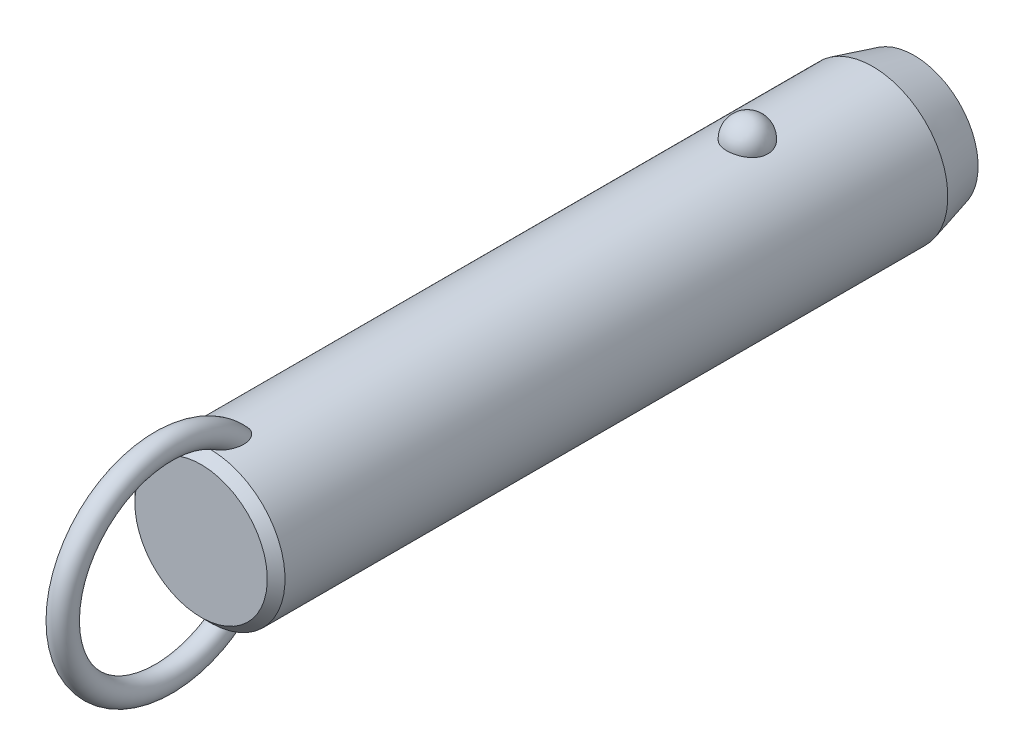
ISO-10303-21;
HEADER;
FILE_DESCRIPTION(('STEP AP214'),'2;1');
FILE_NAME('part.step','',(''),(''),'','','');
FILE_SCHEMA(('AUTOMOTIVE_DESIGN { 1 0 10303 214 1 1 1 1 }'));
ENDSEC;
DATA;
#1=APPLICATION_CONTEXT('core data for automotive mechanical design processes');
#2=APPLICATION_PROTOCOL_DEFINITION('international standard','automotive_design',2000,#1);
#3=PRODUCT_CONTEXT('',#1,'mechanical');
#4=PRODUCT('Part','Part','',(#3));
#5=PRODUCT_RELATED_PRODUCT_CATEGORY('part','',(#4));
#6=PRODUCT_DEFINITION_FORMATION('','',#4);
#7=PRODUCT_DEFINITION_CONTEXT('part definition',#1,'design');
#8=PRODUCT_DEFINITION('design','',#6,#7);
#9=PRODUCT_DEFINITION_SHAPE('','',#8);
#10=(LENGTH_UNIT() NAMED_UNIT(*) SI_UNIT(.MILLI.,.METRE.));
#11=(NAMED_UNIT(*) PLANE_ANGLE_UNIT() SI_UNIT($,.RADIAN.));
#12=(NAMED_UNIT(*) SI_UNIT($,.STERADIAN.) SOLID_ANGLE_UNIT());
#13=UNCERTAINTY_MEASURE_WITH_UNIT(LENGTH_MEASURE(1.E-05),#10,'distance_accuracy_value','');
#14=(GEOMETRIC_REPRESENTATION_CONTEXT(3) GLOBAL_UNCERTAINTY_ASSIGNED_CONTEXT((#13)) GLOBAL_UNIT_ASSIGNED_CONTEXT((#10,
#11,#12)) REPRESENTATION_CONTEXT('',''));
#15=CARTESIAN_POINT('',(0.,0.,0.));
#16=DIRECTION('',(0.,0.,1.));
#17=DIRECTION('',(1.,0.,0.));
#18=AXIS2_PLACEMENT_3D('',#15,#16,#17);
#19=CARTESIAN_POINT('',(0.,0.,76.2));
#20=DIRECTION('',(0.,0.,-1.));
#21=DIRECTION('',(-1.,0.,0.));
#22=AXIS2_PLACEMENT_3D('',#19,#20,#21);
#23=CYLINDRICAL_SURFACE('',#22,12.7);
#24=CARTESIAN_POINT('',(3.46661256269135,12.2177165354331,-3.5));
#25=CARTESIAN_POINT('',(3.4666090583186,12.2177194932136,-3.30432790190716));
#26=CARTESIAN_POINT('',(3.45063567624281,12.2222841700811,-3.10861112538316));
#27=CARTESIAN_POINT('',(3.38712451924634,12.2400345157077,-2.72271899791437));
#28=CARTESIAN_POINT('',(3.33957415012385,12.2532236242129,-2.53254588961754));
#29=CARTESIAN_POINT('',(3.2141234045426,12.286724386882,-2.16324948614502));
#30=CARTESIAN_POINT('',(3.13623639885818,12.3070329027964,-1.98412136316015));
#31=CARTESIAN_POINT('',(2.95205930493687,12.3525018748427,-1.64180592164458));
#32=CARTESIAN_POINT('',(2.84577003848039,12.3776621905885,-1.47861814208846));
#33=CARTESIAN_POINT('',(2.60688050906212,12.4301712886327,-1.17190583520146));
#34=CARTESIAN_POINT('',(2.47415697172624,12.4575299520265,-1.02847897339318));
#35=CARTESIAN_POINT('',(2.18615174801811,12.5112810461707,-0.766177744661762));
#36=CARTESIAN_POINT('',(2.03087002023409,12.5376734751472,-0.64730342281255));
#37=CARTESIAN_POINT('',(1.70237334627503,12.5864761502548,-0.437732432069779));
#38=CARTESIAN_POINT('',(1.52920948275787,12.6088972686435,-0.346958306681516));
#39=CARTESIAN_POINT('',(1.16944170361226,12.6473352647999,-0.195750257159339));
#40=CARTESIAN_POINT('',(0.982839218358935,12.663352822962,-0.135313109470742));
#41=CARTESIAN_POINT('',(0.604961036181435,12.6869706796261,-0.0473241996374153));
#42=CARTESIAN_POINT('',(0.413823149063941,12.6947125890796,-0.0192185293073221));
#43=CARTESIAN_POINT('',(0.0293827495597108,12.7014203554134,0.00517254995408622));
#44=CARTESIAN_POINT('',(-0.163919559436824,12.7003870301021,0.00146092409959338));
#45=CARTESIAN_POINT('',(-0.544374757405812,12.689735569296,-0.0373939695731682));
#46=CARTESIAN_POINT('',(-0.731575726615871,12.6802364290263,-0.0721015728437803));
#47=CARTESIAN_POINT('',(-1.09733277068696,12.6538333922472,-0.171364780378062));
#48=CARTESIAN_POINT('',(-1.27588869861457,12.6369293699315,-0.235920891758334));
#49=CARTESIAN_POINT('',(-1.6204698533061,12.5973946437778,-0.393548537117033));
#50=CARTESIAN_POINT('',(-1.78641865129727,12.5747321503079,-0.486778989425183));
#51=CARTESIAN_POINT('',(-2.10030671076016,12.5261316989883,-0.699110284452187));
#52=CARTESIAN_POINT('',(-2.24824419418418,12.5001934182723,-0.818213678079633));
#53=CARTESIAN_POINT('',(-2.52491489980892,12.4472906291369,-1.08157124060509));
#54=CARTESIAN_POINT('',(-2.65324222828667,12.4203160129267,-1.22624992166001));
#55=CARTESIAN_POINT('',(-2.88410007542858,12.3687509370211,-1.53528325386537));
#56=CARTESIAN_POINT('',(-2.98662883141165,12.3441606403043,-1.69963924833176));
#57=CARTESIAN_POINT('',(-3.16432417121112,12.2998199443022,-2.04548497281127));
#58=CARTESIAN_POINT('',(-3.23917525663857,12.2801261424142,-2.22714424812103));
#59=CARTESIAN_POINT('',(-3.35800573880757,12.248167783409,-2.6009138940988));
#60=CARTESIAN_POINT('',(-3.4019860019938,12.2359030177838,-2.79302397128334));
#61=CARTESIAN_POINT('',(-3.45784812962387,12.2202347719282,-3.18140279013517));
#62=CARTESIAN_POINT('',(-3.46986123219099,12.2167950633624,-3.37765118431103));
#63=CARTESIAN_POINT('',(-3.46186273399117,12.2190638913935,-3.76943689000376));
#64=CARTESIAN_POINT('',(-3.44185196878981,12.2247721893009,-3.96497421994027));
#65=CARTESIAN_POINT('',(-3.37048652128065,12.2446381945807,-4.34881728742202));
#66=CARTESIAN_POINT('',(-3.31928253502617,12.2587552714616,-4.53715319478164));
#67=CARTESIAN_POINT('',(-3.18693461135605,12.2938237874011,-4.90231727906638));
#68=CARTESIAN_POINT('',(-3.1057895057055,12.3147754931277,-5.07914500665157));
#69=CARTESIAN_POINT('',(-2.91506431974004,12.3613125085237,-5.41732059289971));
#70=CARTESIAN_POINT('',(-2.80533587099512,12.3869217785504,-5.57858147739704));
#71=CARTESIAN_POINT('',(-2.560414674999,12.4398525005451,-5.88013283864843));
#72=CARTESIAN_POINT('',(-2.42522099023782,12.4671740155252,-6.02042254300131));
#73=CARTESIAN_POINT('',(-2.1323357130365,12.5205965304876,-6.27662798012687));
#74=CARTESIAN_POINT('',(-1.97456596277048,12.5466928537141,-6.3924554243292));
#75=CARTESIAN_POINT('',(-1.64115839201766,12.5946384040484,-6.59583547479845));
#76=CARTESIAN_POINT('',(-1.46552179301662,12.6164879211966,-6.68339001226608));
#77=CARTESIAN_POINT('',(-1.10356050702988,12.6532533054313,-6.82682153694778));
#78=CARTESIAN_POINT('',(-0.917391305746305,12.6682500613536,-6.8830698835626));
#79=CARTESIAN_POINT('',(-0.537836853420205,12.6900288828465,-6.96386887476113));
#80=CARTESIAN_POINT('',(-0.344452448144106,12.6968119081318,-6.9884232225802));
#81=CARTESIAN_POINT('',(0.0402577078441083,12.7013667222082,-7.00496469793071));
#82=CARTESIAN_POINT('',(0.231556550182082,12.6993008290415,-6.99753844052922));
#83=CARTESIAN_POINT('',(0.610105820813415,12.6867505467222,-6.9516636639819));
#84=CARTESIAN_POINT('',(0.797356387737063,12.6762664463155,-6.913216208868));
#85=CARTESIAN_POINT('',(1.16186657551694,12.6480587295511,-6.80658431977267));
#86=CARTESIAN_POINT('',(1.33915951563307,12.6303611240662,-6.73850666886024));
#87=CARTESIAN_POINT('',(1.67968518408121,12.5896027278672,-6.5745087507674));
#88=CARTESIAN_POINT('',(1.84291705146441,12.5665416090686,-6.47858678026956));
#89=CARTESIAN_POINT('',(2.15340192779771,12.5171072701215,-6.25982455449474));
#90=CARTESIAN_POINT('',(2.30037831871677,12.4906895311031,-6.13660186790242));
#91=CARTESIAN_POINT('',(2.5717412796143,12.4376567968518,-5.86739587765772));
#92=CARTESIAN_POINT('',(2.69612388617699,12.4110417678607,-5.72140858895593));
#93=CARTESIAN_POINT('',(2.92107785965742,12.360051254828,-5.40794137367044));
#94=CARTESIAN_POINT('',(3.02121329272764,12.3357209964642,-5.24014110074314));
#95=CARTESIAN_POINT('',(3.19236291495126,12.2925446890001,-4.88969865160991));
#96=CARTESIAN_POINT('',(3.26338839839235,12.2736965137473,-4.70706226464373));
#97=CARTESIAN_POINT('',(3.36788038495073,12.245404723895,-4.35469510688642));
#98=CARTESIAN_POINT('',(3.40484026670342,12.2351018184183,-4.18605935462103));
#99=CARTESIAN_POINT('',(3.45420764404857,12.2212564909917,-3.84496058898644));
#100=CARTESIAN_POINT('',(3.46661565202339,12.2177139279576,-3.67249765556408));
#101=CARTESIAN_POINT('',(3.46661256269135,12.2177165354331,-3.5));
#102=B_SPLINE_CURVE_WITH_KNOTS('',3,(#24,#25,#26,#27,#28,#29,#30,#31,#32,#33,#34,#35,#36,#37,
#38,#39,#40,#41,#42,#43,#44,#45,#46,#47,#48,#49,#50,#51,#52,#53,#54,#55,#56,#57,#58,#59,#60,#61,
#62,#63,#64,#65,#66,#67,#68,#69,#70,#71,#72,#73,#74,#75,#76,#77,#78,#79,#80,#81,#82,#83,#84,#85,
#86,#87,#88,#89,#90,#91,#92,#93,#94,#95,#96,#97,#98,#99,#100,#101),.UNSPECIFIED.,.T.,.F.,(4,2,2,
2,2,2,2,2,2,2,2,2,2,2,2,2,2,2,2,2,2,2,2,2,2,2,2,2,2,2,2,2,2,2,2,2,2,2,4),(0.,0.586396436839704,
1.17302689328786,1.7593990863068,2.34575431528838,2.93491084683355,3.52406845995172,
4.11158733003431,4.69904375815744,5.2762784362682,5.85345931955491,6.42265312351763,
6.99185659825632,7.56427334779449,8.136746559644,8.71981013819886,9.3029135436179,
9.89247258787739,10.4820150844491,11.0691335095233,11.6562366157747,12.2405256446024,
12.8248374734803,13.412244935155,13.9996740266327,14.5891883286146,15.1786623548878,
15.7609861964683,16.3432419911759,16.914863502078,17.4864654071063,18.056024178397,
18.6256177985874,19.2037609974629,19.7820055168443,20.3699810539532,20.9577282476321,
21.4746855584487,21.9916320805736),.UNSPECIFIED.);
#103=CARTESIAN_POINT('',(3.46661256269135,12.2177165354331,-3.5));
#104=VERTEX_POINT('',#103);
#105=EDGE_CURVE('E41',#104,#104,#102,.T.);
#106=ORIENTED_EDGE('',*,*,#105,.T.);
#107=EDGE_LOOP('',(#106));
#108=FACE_BOUND('',#107,.T.);
#109=CARTESIAN_POINT('',(0.,0.,87.4000000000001));
#110=DIRECTION('',(0.,0.,1.));
#111=DIRECTION('',(1.,0.,0.));
#112=AXIS2_PLACEMENT_3D('',#109,#110,#111);
#113=CIRCLE('',#112,12.7);
#114=CARTESIAN_POINT('',(-12.7,0.,87.4000000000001));
#115=VERTEX_POINT('',#114);
#116=EDGE_CURVE('E10',#115,#115,#113,.F.);
#117=ORIENTED_EDGE('',*,*,#116,.T.);
#118=EDGE_LOOP('',(#117));
#119=FACE_BOUND('',#118,.T.);
#120=CARTESIAN_POINT('',(-0.548122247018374,-12.6881662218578,81.1432187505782));
#121=CARTESIAN_POINT('',(-0.648865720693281,-12.6838128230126,81.177926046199));
#122=CARTESIAN_POINT('',(-0.746398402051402,-12.6783867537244,81.2220428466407));
#123=CARTESIAN_POINT('',(-0.93212506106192,-12.666091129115,81.3267647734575));
#124=CARTESIAN_POINT('',(-1.02030388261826,-12.6592192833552,81.387396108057));
#125=CARTESIAN_POINT('',(-1.18487740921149,-12.6448747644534,81.521847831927));
#126=CARTESIAN_POINT('',(-1.26134296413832,-12.637406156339,81.5955825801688));
#127=CARTESIAN_POINT('',(-1.40231200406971,-12.6225412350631,81.7536045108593));
#128=CARTESIAN_POINT('',(-1.46681470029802,-12.6151449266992,81.8378923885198));
#129=CARTESIAN_POINT('',(-1.60714786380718,-12.5981718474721,82.0496577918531));
#130=CARTESIAN_POINT('',(-1.67725126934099,-12.588900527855,82.180962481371));
#131=CARTESIAN_POINT('',(-1.79536591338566,-12.5725964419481,82.4532471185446));
#132=CARTESIAN_POINT('',(-1.84333535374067,-12.5655679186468,82.5942447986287));
#133=CARTESIAN_POINT('',(-1.93422576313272,-12.5519624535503,82.9376455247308));
#134=CARTESIAN_POINT('',(-1.96788773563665,-12.5466298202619,83.1425578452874));
#135=CARTESIAN_POINT('',(-1.9941399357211,-12.542463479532,83.4517600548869));
#136=CARTESIAN_POINT('',(-1.99883864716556,-12.5417153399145,83.5552987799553));
#137=CARTESIAN_POINT('',(-2.00078003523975,-12.5414074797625,83.7624512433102));
#138=CARTESIAN_POINT('',(-1.99802449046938,-12.5418474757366,83.8660649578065));
#139=CARTESIAN_POINT('',(-1.98336733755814,-12.5441750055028,84.1103207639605));
#140=CARTESIAN_POINT('',(-1.96851430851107,-12.5465291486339,84.2507804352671));
#141=CARTESIAN_POINT('',(-1.92707089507,-12.5529612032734,84.5299607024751));
#142=CARTESIAN_POINT('',(-1.90047458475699,-12.5570399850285,84.6686803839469));
#143=CARTESIAN_POINT('',(-1.8361912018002,-12.5666008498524,84.9434113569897));
#144=CARTESIAN_POINT('',(-1.79850828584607,-12.57208240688,85.0794236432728));
#145=CARTESIAN_POINT('',(-1.71223796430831,-12.5841228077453,85.3478421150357));
#146=CARTESIAN_POINT('',(-1.66365679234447,-12.5906810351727,85.4802503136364));
#147=CARTESIAN_POINT('',(-1.57804503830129,-12.6016176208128,85.6854887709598));
#148=CARTESIAN_POINT('',(-1.5447725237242,-12.6057501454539,85.7599149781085));
#149=CARTESIAN_POINT('',(-1.47424480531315,-12.6141930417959,85.9068393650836));
#150=CARTESIAN_POINT('',(-1.436990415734,-12.6185033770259,85.9793379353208));
#151=CARTESIAN_POINT('',(-1.35825795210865,-12.6272207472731,86.1218926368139));
#152=CARTESIAN_POINT('',(-1.31678520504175,-12.6316276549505,86.1919517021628));
#153=CARTESIAN_POINT('',(-1.22917793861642,-12.6404532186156,86.3290705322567));
#154=CARTESIAN_POINT('',(-1.18304514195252,-12.6448718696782,86.3961313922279));
#155=CARTESIAN_POINT('',(-1.07246411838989,-12.6547893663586,86.5438741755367));
#156=CARTESIAN_POINT('',(-1.00642239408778,-12.6602600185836,86.6233844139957));
#157=CARTESIAN_POINT('',(-0.864441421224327,-12.6707460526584,86.7731698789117));
#158=CARTESIAN_POINT('',(-0.788516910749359,-12.6757620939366,86.8434585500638));
#159=CARTESIAN_POINT('',(-0.652215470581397,-12.6833591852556,86.9486801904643));
#160=CARTESIAN_POINT('',(-0.594982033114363,-12.6861973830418,86.9876241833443));
#161=CARTESIAN_POINT('',(-0.475269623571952,-12.6912445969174,87.0564899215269));
#162=CARTESIAN_POINT('',(-0.412800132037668,-12.6934547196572,87.0864275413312));
#163=CARTESIAN_POINT('',(-0.295749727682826,-12.6966636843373,87.1297565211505));
#164=CARTESIAN_POINT('',(-0.241949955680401,-12.6978134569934,87.1452188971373));
#165=CARTESIAN_POINT('',(-0.132508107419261,-12.6994261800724,87.1668845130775));
#166=CARTESIAN_POINT('',(-0.0768679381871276,-12.6998898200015,87.1730970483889));
#167=CARTESIAN_POINT('',(0.0347696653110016,-12.7000752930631,87.1755838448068));
#168=CARTESIAN_POINT('',(0.0907676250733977,-12.6997954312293,87.1718353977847));
#169=CARTESIAN_POINT('',(0.201283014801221,-12.6985255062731,87.1547883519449));
#170=CARTESIAN_POINT('',(0.255799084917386,-12.6975348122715,87.1414812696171));
#171=CARTESIAN_POINT('',(0.376042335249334,-12.6946091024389,87.1020379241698));
#172=CARTESIAN_POINT('',(0.440950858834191,-12.6924943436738,87.0734492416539));
#173=CARTESIAN_POINT('',(0.565350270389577,-12.6875639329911,87.0063234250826));
#174=CARTESIAN_POINT('',(0.624828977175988,-12.6847467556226,86.9677646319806));
#175=CARTESIAN_POINT('',(0.774116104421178,-12.6767252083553,86.856949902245));
#176=CARTESIAN_POINT('',(0.859449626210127,-12.6711344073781,86.7787605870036));
#177=CARTESIAN_POINT('',(1.01789440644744,-12.6593922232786,86.610943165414));
#178=CARTESIAN_POINT('',(1.09096902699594,-12.653239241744,86.521282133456));
#179=CARTESIAN_POINT('',(1.22268793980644,-12.6411674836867,86.3402658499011));
#180=CARTESIAN_POINT('',(1.28193986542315,-12.6352572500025,86.249345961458));
#181=CARTESIAN_POINT('',(1.39259777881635,-12.6235401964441,86.0627929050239));
#182=CARTESIAN_POINT('',(1.44399707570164,-12.6177334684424,85.9671558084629));
#183=CARTESIAN_POINT('',(1.53972870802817,-12.6064093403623,85.7722738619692));
#184=CARTESIAN_POINT('',(1.58405262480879,-12.6008922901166,85.6730248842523));
#185=CARTESIAN_POINT('',(1.66600705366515,-12.5903187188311,85.4717727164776));
#186=CARTESIAN_POINT('',(1.70363651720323,-12.5852622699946,85.3697690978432));
#187=CARTESIAN_POINT('',(1.7754537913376,-12.5753406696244,85.1543580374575));
#188=CARTESIAN_POINT('',(1.80903453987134,-12.5705328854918,85.0407454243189));
#189=CARTESIAN_POINT('',(1.86844163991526,-12.5618400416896,84.8114575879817));
#190=CARTESIAN_POINT('',(1.89426665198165,-12.5579551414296,84.6957820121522));
#191=CARTESIAN_POINT('',(1.93785464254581,-12.5513030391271,84.4630072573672));
#192=CARTESIAN_POINT('',(1.95562640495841,-12.5485346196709,84.3459097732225));
#193=CARTESIAN_POINT('',(1.98264463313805,-12.5442934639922,84.1107473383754));
#194=CARTESIAN_POINT('',(1.99189298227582,-12.5428204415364,83.9926826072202));
#195=CARTESIAN_POINT('',(2.00416068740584,-12.540871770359,83.6806225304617));
#196=CARTESIAN_POINT('',(1.99944433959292,-12.541631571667,83.486229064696));
#197=CARTESIAN_POINT('',(1.9611375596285,-12.5476846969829,83.1003095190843));
#198=CARTESIAN_POINT('',(1.92758341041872,-12.5529723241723,82.9087801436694));
#199=CARTESIAN_POINT('',(1.83934342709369,-12.5661532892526,82.5822728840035));
#200=CARTESIAN_POINT('',(1.79215440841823,-12.5730485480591,82.4452499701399));
#201=CARTESIAN_POINT('',(1.67676242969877,-12.588958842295,82.1804459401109));
#202=CARTESIAN_POINT('',(1.60859050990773,-12.597970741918,82.0526515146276));
#203=CARTESIAN_POINT('',(1.4658383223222,-12.6152829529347,81.8358006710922));
#204=CARTESIAN_POINT('',(1.39525727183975,-12.6233659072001,81.7441050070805));
#205=CARTESIAN_POINT('',(1.2399259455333,-12.6395676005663,81.5734854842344));
#206=CARTESIAN_POINT('',(1.15517932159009,-12.6476863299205,81.4945583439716));
#207=CARTESIAN_POINT('',(0.971995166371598,-12.6630846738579,81.3526438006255));
#208=CARTESIAN_POINT('',(0.873456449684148,-12.6703572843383,81.289784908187));
#209=CARTESIAN_POINT('',(0.665847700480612,-12.6829569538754,81.1844870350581));
#210=CARTESIAN_POINT('',(0.556784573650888,-12.688285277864,81.1420347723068));
#211=CARTESIAN_POINT('',(0.347338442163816,-12.6956226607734,81.0844434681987));
#212=CARTESIAN_POINT('',(0.247759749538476,-12.6979816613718,81.0663996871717));
#213=CARTESIAN_POINT('',(0.0470218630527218,-12.7003077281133,81.0486007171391));
#214=CARTESIAN_POINT('',(-0.0541350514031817,-12.7002779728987,81.0488212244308));
#215=CARTESIAN_POINT('',(-0.221414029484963,-12.6982482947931,81.0643639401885));
#216=CARTESIAN_POINT('',(-0.28805588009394,-12.6969033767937,81.0746662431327));
#217=CARTESIAN_POINT('',(-0.419599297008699,-12.6932369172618,81.1031348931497));
#218=CARTESIAN_POINT('',(-0.484501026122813,-12.6909154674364,81.1213005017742));
#219=CARTESIAN_POINT('',(-0.548122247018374,-12.6881662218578,81.1432187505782));
#220=B_SPLINE_CURVE_WITH_KNOTS('',3,(#120,#121,#122,#123,#124,#125,#126,#127,#128,#129,#130,
#131,#132,#133,#134,#135,#136,#137,#138,#139,#140,#141,#142,#143,#144,#145,#146,#147,#148,#149,
#150,#151,#152,#153,#154,#155,#156,#157,#158,#159,#160,#161,#162,#163,#164,#165,#166,#167,#168,
#169,#170,#171,#172,#173,#174,#175,#176,#177,#178,#179,#180,#181,#182,#183,#184,#185,#186,#187,
#188,#189,#190,#191,#192,#193,#194,#195,#196,#197,#198,#199,#200,#201,#202,#203,#204,#205,#206,
#207,#208,#209,#210,#211,#212,#213,#214,#215,#216,#217,#218,#219),.UNSPECIFIED.,.T.,.F.,(4,2,2,
2,2,2,2,2,2,2,2,2,2,2,2,2,2,2,2,2,2,2,2,2,2,2,2,2,2,2,2,2,2,2,2,2,2,2,2,2,2,2,2,2,2,2,2,2,2,4),
(0.,0.319642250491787,0.639794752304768,0.957927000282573,1.27608021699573,1.72100165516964,
2.16675988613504,2.78630021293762,3.09705782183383,3.40774128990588,3.83096358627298,
4.25439969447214,4.67767724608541,5.10071330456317,5.34550297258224,5.59024267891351,
5.83467707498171,6.07902143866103,6.38891080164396,6.69834321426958,6.90560910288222,
7.11250749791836,7.27977315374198,7.44687060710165,7.61434932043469,7.78197685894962,
7.99365544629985,8.20579780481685,8.55147335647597,8.89816429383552,9.22375138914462,
9.54961437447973,9.87586224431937,10.202161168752,10.5575872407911,10.9130746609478,
11.2681734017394,11.6231936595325,12.2046601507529,12.7853961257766,13.219164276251,
13.6522938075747,13.9989174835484,14.3454519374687,14.6946768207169,15.0436740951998,
15.3457513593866,15.6474266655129,15.8493051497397,16.0511646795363),.UNSPECIFIED.);
#221=CARTESIAN_POINT('',(-0.548122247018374,-12.6881662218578,81.1432187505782));
#222=VERTEX_POINT('',#221);
#223=EDGE_CURVE('E59',#222,#222,#220,.T.);
#224=ORIENTED_EDGE('',*,*,#223,.T.);
#225=EDGE_LOOP('',(#224));
#226=FACE_BOUND('',#225,.T.);
#227=CARTESIAN_POINT('',(-0.548122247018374,12.6881662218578,81.1432187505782));
#228=CARTESIAN_POINT('',(-0.459436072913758,12.6919968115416,81.112673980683));
#229=CARTESIAN_POINT('',(-0.368189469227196,12.6949996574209,81.0893913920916));
#230=CARTESIAN_POINT('',(-0.183024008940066,12.6990186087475,81.0584062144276));
#231=CARTESIAN_POINT('',(-0.0891049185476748,12.7000345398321,81.0507049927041));
#232=CARTESIAN_POINT('',(0.0987147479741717,12.6999636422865,81.0512455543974));
#233=CARTESIAN_POINT('',(0.192615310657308,12.6988761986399,81.0594920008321));
#234=CARTESIAN_POINT('',(0.377658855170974,12.6947211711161,81.0915515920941));
#235=CARTESIAN_POINT('',(0.468801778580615,12.6916535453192,81.1153650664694));
#236=CARTESIAN_POINT('',(0.645809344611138,12.6838788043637,81.1774565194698));
#237=CARTESIAN_POINT('',(0.731679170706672,12.6791733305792,81.215720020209));
#238=CARTESIAN_POINT('',(0.896315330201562,12.6686004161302,81.305120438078));
#239=CARTESIAN_POINT('',(0.975080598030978,12.6627328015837,81.3562592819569));
#240=CARTESIAN_POINT('',(1.12963655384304,12.6499161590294,81.4736782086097));
#241=CARTESIAN_POINT('',(1.20478673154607,12.6429194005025,81.5407929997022));
#242=CARTESIAN_POINT('',(1.34448241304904,12.6288282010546,81.6852250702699));
#243=CARTESIAN_POINT('',(1.40902173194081,12.621733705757,81.7625482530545));
#244=CARTESIAN_POINT('',(1.55208211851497,12.6050877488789,81.9592475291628));
#245=CARTESIAN_POINT('',(1.62510490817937,12.5957546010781,82.0826540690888));
#246=CARTESIAN_POINT('',(1.7501904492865,12.5789823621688,82.3397690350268));
#247=CARTESIAN_POINT('',(1.80221377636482,12.5715468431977,82.473496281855));
#248=CARTESIAN_POINT('',(1.90309965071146,12.5567434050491,82.7983516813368));
#249=CARTESIAN_POINT('',(1.94342317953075,12.5504515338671,82.9921611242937));
#250=CARTESIAN_POINT('',(1.99332997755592,12.5426147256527,83.3837881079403));
#251=CARTESIAN_POINT('',(2.00285305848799,12.5410790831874,83.5816127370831));
#252=CARTESIAN_POINT('',(1.99678999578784,12.5420407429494,83.9166427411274));
#253=CARTESIAN_POINT('',(1.98794117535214,12.5434564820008,84.0540428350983));
#254=CARTESIAN_POINT('',(1.95865119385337,12.5480641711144,84.3276394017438));
#255=CARTESIAN_POINT('',(1.9382043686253,12.5512569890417,84.4638352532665));
#256=CARTESIAN_POINT('',(1.88647896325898,12.5591352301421,84.7342493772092));
#257=CARTESIAN_POINT('',(1.85518800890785,12.5638223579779,84.8684652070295));
#258=CARTESIAN_POINT('',(1.78217886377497,12.5743868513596,85.1339362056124));
#259=CARTESIAN_POINT('',(1.74046509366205,12.5802637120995,85.2651926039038));
#260=CARTESIAN_POINT('',(1.66024095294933,12.5910571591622,85.4860855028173));
#261=CARTESIAN_POINT('',(1.62434772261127,12.5957535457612,85.5766904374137));
#262=CARTESIAN_POINT('',(1.5470900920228,12.6054762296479,85.7555125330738));
#263=CARTESIAN_POINT('',(1.50572681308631,12.6105024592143,85.8437301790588));
#264=CARTESIAN_POINT('',(1.41728020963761,12.620748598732,86.0169321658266));
#265=CARTESIAN_POINT('',(1.37021377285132,12.625967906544,86.1019251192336));
#266=CARTESIAN_POINT('',(1.2696962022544,12.6364721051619,86.2680072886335));
#267=CARTESIAN_POINT('',(1.21624929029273,12.6417569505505,86.3490990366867));
#268=CARTESIAN_POINT('',(1.10304413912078,12.6521331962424,86.5047027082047));
#269=CARTESIAN_POINT('',(1.04340936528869,12.657226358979,86.5793033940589));
#270=CARTESIAN_POINT('',(0.915919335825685,12.6670906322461,86.721324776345));
#271=CARTESIAN_POINT('',(0.848064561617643,12.6718617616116,86.7887458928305));
#272=CARTESIAN_POINT('',(0.717035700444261,12.67987711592,86.9006247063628));
#273=CARTESIAN_POINT('',(0.655526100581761,12.6832377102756,86.9469970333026));
#274=CARTESIAN_POINT('',(0.525985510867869,12.6892676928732,87.0296195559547));
#275=CARTESIAN_POINT('',(0.457969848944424,12.6919386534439,87.0658927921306));
#276=CARTESIAN_POINT('',(0.334859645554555,12.695691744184,87.1166572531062));
#277=CARTESIAN_POINT('',(0.281116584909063,12.6970073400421,87.1343733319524));
#278=CARTESIAN_POINT('',(0.17142581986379,12.6989609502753,87.1606429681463));
#279=CARTESIAN_POINT('',(0.11548082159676,12.699599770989,87.1692074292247));
#280=CARTESIAN_POINT('',(0.00272618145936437,12.7001251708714,87.1762531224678));
#281=CARTESIAN_POINT('',(-0.0540859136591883,12.7000089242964,87.1746964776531));
#282=CARTESIAN_POINT('',(-0.166544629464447,12.6990328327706,87.1616005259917));
#283=CARTESIAN_POINT('',(-0.222190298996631,12.6981724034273,87.1500533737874));
#284=CARTESIAN_POINT('',(-0.342018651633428,12.695562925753,87.1149128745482));
#285=CARTESIAN_POINT('',(-0.405606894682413,12.6936676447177,87.0893322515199));
#286=CARTESIAN_POINT('',(-0.527815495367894,12.6891754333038,87.0283111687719));
#287=CARTESIAN_POINT('',(-0.586425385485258,12.6865770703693,86.9928505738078));
#288=CARTESIAN_POINT('',(-0.731842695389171,12.6792129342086,86.8914960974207));
#289=CARTESIAN_POINT('',(-0.814709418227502,12.6740767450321,86.8200395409));
#290=CARTESIAN_POINT('',(-0.969101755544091,12.6632083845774,86.6658900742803));
#291=CARTESIAN_POINT('',(-1.04059564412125,12.6574746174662,86.5831668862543));
#292=CARTESIAN_POINT('',(-1.16981116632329,12.6461638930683,86.4158096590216));
#293=CARTESIAN_POINT('',(-1.22811369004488,12.6405994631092,86.3316166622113));
#294=CARTESIAN_POINT('',(-1.3374340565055,12.6295007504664,86.1585791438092));
#295=CARTESIAN_POINT('',(-1.38844577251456,12.6239664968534,86.0697307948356));
#296=CARTESIAN_POINT('',(-1.4840070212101,12.6130898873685,85.888389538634));
#297=CARTESIAN_POINT('',(-1.52854232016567,12.6077479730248,85.7958891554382));
#298=CARTESIAN_POINT('',(-1.61150113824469,12.5974127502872,85.6081607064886));
#299=CARTESIAN_POINT('',(-1.64992317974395,12.5924195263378,85.5129319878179));
#300=CARTESIAN_POINT('',(-1.73468589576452,12.581070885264,85.2828936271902));
#301=CARTESIAN_POINT('',(-1.77831261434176,12.5749388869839,85.1470661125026));
#302=CARTESIAN_POINT('',(-1.85439734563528,12.5639437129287,84.8722128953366));
#303=CARTESIAN_POINT('',(-1.88684994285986,12.5590811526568,84.7331856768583));
#304=CARTESIAN_POINT('',(-1.94008483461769,12.550968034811,84.4530923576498));
#305=CARTESIAN_POINT('',(-1.96088706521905,12.5477147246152,84.3120301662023));
#306=CARTESIAN_POINT('',(-1.99000539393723,12.5431291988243,84.0286689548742));
#307=CARTESIAN_POINT('',(-1.99832911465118,12.5417958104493,83.8863707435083));
#308=CARTESIAN_POINT('',(-2.00166624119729,12.5412674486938,83.5576271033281));
#309=CARTESIAN_POINT('',(-1.99178843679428,12.5428579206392,83.371088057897));
#310=CARTESIAN_POINT('',(-1.9445518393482,12.5502731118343,83.0016240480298));
#311=CARTESIAN_POINT('',(-1.90724032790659,12.5560905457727,82.8186934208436));
#312=CARTESIAN_POINT('',(-1.81330718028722,12.5699462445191,82.5048488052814));
#313=CARTESIAN_POINT('',(-1.76338820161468,12.5771273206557,82.3719105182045));
#314=CARTESIAN_POINT('',(-1.64305018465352,12.593414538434,82.1156813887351));
#315=CARTESIAN_POINT('',(-1.57265346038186,12.6025185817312,81.992380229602));
#316=CARTESIAN_POINT('',(-1.42634956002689,12.6198178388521,81.7835648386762));
#317=CARTESIAN_POINT('',(-1.3542377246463,12.6278405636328,81.6953846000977));
#318=CARTESIAN_POINT('',(-1.19645664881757,12.6437632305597,81.532107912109));
#319=CARTESIAN_POINT('',(-1.11080536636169,12.6516633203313,81.4569944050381));
#320=CARTESIAN_POINT('',(-0.947219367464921,12.6648319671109,81.3378114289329));
#321=CARTESIAN_POINT('',(-0.871624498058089,12.670300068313,81.2905414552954));
#322=CARTESIAN_POINT('',(-0.714161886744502,12.6801492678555,81.2077413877));
#323=CARTESIAN_POINT('',(-0.632295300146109,12.684530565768,81.1722091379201));
#324=CARTESIAN_POINT('',(-0.548122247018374,12.6881662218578,81.1432187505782));
#325=B_SPLINE_CURVE_WITH_KNOTS('',3,(#227,#228,#229,#230,#231,#232,#233,#234,#235,#236,#237,
#238,#239,#240,#241,#242,#243,#244,#245,#246,#247,#248,#249,#250,#251,#252,#253,#254,#255,#256,
#257,#258,#259,#260,#261,#262,#263,#264,#265,#266,#267,#268,#269,#270,#271,#272,#273,#274,#275,
#276,#277,#278,#279,#280,#281,#282,#283,#284,#285,#286,#287,#288,#289,#290,#291,#292,#293,#294,
#295,#296,#297,#298,#299,#300,#301,#302,#303,#304,#305,#306,#307,#308,#309,#310,#311,#312,#313,
#314,#315,#316,#317,#318,#319,#320,#321,#322,#323,#324),.UNSPECIFIED.,.T.,.F.,(4,2,2,2,2,2,2,2,
2,2,2,2,2,2,2,2,2,2,2,2,2,2,2,2,2,2,2,2,2,2,2,2,2,2,2,2,2,2,2,2,2,2,2,2,2,2,2,2,4),(0.,
0.281328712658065,0.562682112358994,0.844117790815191,1.12555942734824,1.40671982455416,
1.68792232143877,1.98972294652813,2.29169886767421,2.72039860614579,3.14989948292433,
3.74084916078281,4.33295293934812,4.74554109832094,5.15833092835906,5.57159335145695,
5.98468079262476,6.27722775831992,6.56971484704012,6.86135609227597,7.15280542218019,
7.43927407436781,7.72572595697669,7.95635862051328,8.18646071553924,8.35559393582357,
8.52452541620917,8.69408946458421,8.86378678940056,9.06834348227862,9.27332014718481,
9.60010414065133,9.92778432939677,10.2350252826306,10.5425229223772,10.8506864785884,
11.1589244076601,11.5867893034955,12.0148612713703,12.4421984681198,12.8692745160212,
13.4279365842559,13.9856380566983,14.4107062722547,14.8353130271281,15.1765567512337,
15.5173516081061,15.7844129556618,16.051425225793),.UNSPECIFIED.);
#326=CARTESIAN_POINT('',(-0.548122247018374,12.6881662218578,81.1432187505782));
#327=VERTEX_POINT('',#326);
#328=EDGE_CURVE('E67',#327,#327,#325,.T.);
#329=ORIENTED_EDGE('',*,*,#328,.T.);
#330=EDGE_LOOP('',(#329));
#331=FACE_BOUND('',#330,.T.);
#332=CARTESIAN_POINT('',(0.,0.,-24.7000000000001));
#333=DIRECTION('',(0.,0.,-1.));
#334=DIRECTION('',(-1.,0.,0.));
#335=AXIS2_PLACEMENT_3D('',#332,#333,#334);
#336=CIRCLE('',#335,12.7);
#337=CARTESIAN_POINT('',(-12.7,0.,-24.7000000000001));
#338=VERTEX_POINT('',#337);
#339=EDGE_CURVE('E56',#338,#338,#336,.F.);
#340=ORIENTED_EDGE('',*,*,#339,.T.);
#341=EDGE_LOOP('',(#340));
#342=FACE_BOUND('',#341,.T.);
#343=ADVANCED_FACE('F37',(#108,#119,#226,#331,#342),#23,.T.);
#344=CARTESIAN_POINT('',(0.,0.,-31.7));
#345=DIRECTION('',(0.,0.,-1.));
#346=DIRECTION('',(-1.,0.,0.));
#347=AXIS2_PLACEMENT_3D('',#344,#345,#346);
#348=PLANE('',#347);
#349=CARTESIAN_POINT('',(0.,0.,-31.7));
#350=DIRECTION('',(0.,0.,-1.));
#351=DIRECTION('',(-1.,0.,0.));
#352=AXIS2_PLACEMENT_3D('',#349,#350,#351);
#353=CIRCLE('',#352,10.8243556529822);
#354=CARTESIAN_POINT('',(-10.8243556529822,0.,-31.7));
#355=VERTEX_POINT('',#354);
#356=EDGE_CURVE('E66',#355,#355,#353,.T.);
#357=ORIENTED_EDGE('',*,*,#356,.T.);
#358=EDGE_LOOP('',(#357));
#359=FACE_BOUND('',#358,.T.);
#360=ADVANCED_FACE('F85',(#359),#348,.T.);
#361=CARTESIAN_POINT('',(0.,0.,-31.7));
#362=DIRECTION('',(0.,0.,1.));
#363=DIRECTION('',(1.,0.,0.));
#364=AXIS2_PLACEMENT_3D('',#361,#362,#363);
#365=CONICAL_SURFACE('',#364,10.8243556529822,0.26179938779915);
#366=ORIENTED_EDGE('',*,*,#339,.F.);
#367=EDGE_LOOP('',(#366));
#368=FACE_BOUND('',#367,.T.);
#369=ORIENTED_EDGE('',*,*,#356,.F.);
#370=EDGE_LOOP('',(#369));
#371=FACE_BOUND('',#370,.T.);
#372=ADVANCED_FACE('F83',(#368,#371),#365,.T.);
#373=CARTESIAN_POINT('',(0.,0.,88.9));
#374=DIRECTION('',(0.,0.,1.));
#375=DIRECTION('',(1.,0.,0.));
#376=AXIS2_PLACEMENT_3D('',#373,#374,#375);
#377=PLANE('',#376);
#378=CARTESIAN_POINT('',(0.,0.,88.9));
#379=DIRECTION('',(0.,0.,1.));
#380=DIRECTION('',(1.,0.,0.));
#381=AXIS2_PLACEMENT_3D('',#378,#379,#380);
#382=CIRCLE('',#381,11.2000000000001);
#383=CARTESIAN_POINT('',(-11.2000000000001,0.,88.9));
#384=VERTEX_POINT('',#383);
#385=EDGE_CURVE('E50',#384,#384,#382,.T.);
#386=ORIENTED_EDGE('',*,*,#385,.T.);
#387=EDGE_LOOP('',(#386));
#388=FACE_BOUND('',#387,.T.);
#389=ADVANCED_FACE('F77',(#388),#377,.T.);
#390=CARTESIAN_POINT('',(0.,0.,95.25));
#391=DIRECTION('',(1.,0.,0.));
#392=DIRECTION('',(0.,0.,-1.));
#393=AXIS2_PLACEMENT_3D('',#390,#391,#392);
#394=TOROIDAL_SURFACE('',#393,17.05,2.);
#395=ORIENTED_EDGE('',*,*,#328,.F.);
#396=EDGE_LOOP('',(#395));
#397=FACE_BOUND('',#396,.T.);
#398=ORIENTED_EDGE('',*,*,#223,.F.);
#399=EDGE_LOOP('',(#398));
#400=FACE_BOUND('',#399,.T.);
#401=ADVANCED_FACE('F73',(#397,#400),#394,.T.);
#402=CARTESIAN_POINT('',(0.,0.,88.9));
#403=DIRECTION('',(0.,0.,-1.));
#404=DIRECTION('',(-1.,0.,0.));
#405=AXIS2_PLACEMENT_3D('',#402,#403,#404);
#406=CONICAL_SURFACE('',#405,11.2000000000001,0.785398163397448);
#407=CARTESIAN_POINT('',(-12.7,0.,87.4000000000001));
#408=CARTESIAN_POINT('',(-12.684375,0.,87.4156250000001));
#409=CARTESIAN_POINT('',(-12.66875,0.,87.4312500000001));
#410=CARTESIAN_POINT('',(-12.6375,0.,87.4625000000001));
#411=CARTESIAN_POINT('',(-12.621875,0.,87.4781250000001));
#412=CARTESIAN_POINT('',(-12.590625,0.,87.5093750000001));
#413=CARTESIAN_POINT('',(-12.575,0.,87.5250000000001));
#414=CARTESIAN_POINT('',(-12.54375,0.,87.5562500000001));
#415=CARTESIAN_POINT('',(-12.528125,0.,87.5718750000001));
#416=CARTESIAN_POINT('',(-12.496875,0.,87.6031250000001));
#417=CARTESIAN_POINT('',(-12.48125,0.,87.61875));
#418=CARTESIAN_POINT('',(-12.45,0.,87.6500000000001));
#419=CARTESIAN_POINT('',(-12.434375,0.,87.665625));
#420=CARTESIAN_POINT('',(-12.403125,0.,87.6968750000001));
#421=CARTESIAN_POINT('',(-12.3875,0.,87.7125));
#422=CARTESIAN_POINT('',(-12.35625,0.,87.74375));
#423=CARTESIAN_POINT('',(-12.340625,0.,87.7593750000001));
#424=CARTESIAN_POINT('',(-12.309375,0.,87.790625));
#425=CARTESIAN_POINT('',(-12.29375,0.,87.80625));
#426=CARTESIAN_POINT('',(-12.2625,0.,87.8375));
#427=CARTESIAN_POINT('',(-12.246875,0.,87.853125));
#428=CARTESIAN_POINT('',(-12.215625,0.,87.884375));
#429=CARTESIAN_POINT('',(-12.2,0.,87.9));
#430=CARTESIAN_POINT('',(-12.16875,0.,87.93125));
#431=CARTESIAN_POINT('',(-12.153125,0.,87.946875));
#432=CARTESIAN_POINT('',(-12.121875,0.,87.978125));
#433=CARTESIAN_POINT('',(-12.10625,0.,87.99375));
#434=CARTESIAN_POINT('',(-12.075,0.,88.025));
#435=CARTESIAN_POINT('',(-12.059375,0.,88.040625));
#436=CARTESIAN_POINT('',(-12.028125,0.,88.071875));
#437=CARTESIAN_POINT('',(-12.0125,0.,88.0875));
#438=CARTESIAN_POINT('',(-11.98125,0.,88.11875));
#439=CARTESIAN_POINT('',(-11.965625,0.,88.134375));
#440=CARTESIAN_POINT('',(-11.934375,0.,88.165625));
#441=CARTESIAN_POINT('',(-11.91875,0.,88.18125));
#442=CARTESIAN_POINT('',(-11.8875,0.,88.2125));
#443=CARTESIAN_POINT('',(-11.871875,0.,88.228125));
#444=CARTESIAN_POINT('',(-11.840625,0.,88.259375));
#445=CARTESIAN_POINT('',(-11.825,0.,88.275));
#446=CARTESIAN_POINT('',(-11.79375,0.,88.30625));
#447=CARTESIAN_POINT('',(-11.778125,0.,88.321875));
#448=CARTESIAN_POINT('',(-11.7468750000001,0.,88.353125));
#449=CARTESIAN_POINT('',(-11.7312500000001,0.,88.36875));
#450=CARTESIAN_POINT('',(-11.7000000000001,0.,88.4));
#451=CARTESIAN_POINT('',(-11.6843750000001,0.,88.415625));
#452=CARTESIAN_POINT('',(-11.6531250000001,0.,88.446875));
#453=CARTESIAN_POINT('',(-11.6375000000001,0.,88.4625));
#454=CARTESIAN_POINT('',(-11.6062500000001,0.,88.49375));
#455=CARTESIAN_POINT('',(-11.5906250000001,0.,88.509375));
#456=CARTESIAN_POINT('',(-11.5593750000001,0.,88.540625));
#457=CARTESIAN_POINT('',(-11.5437500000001,0.,88.55625));
#458=CARTESIAN_POINT('',(-11.5125000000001,0.,88.5875));
#459=CARTESIAN_POINT('',(-11.4968750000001,0.,88.603125));
#460=CARTESIAN_POINT('',(-11.4656250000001,0.,88.634375));
#461=CARTESIAN_POINT('',(-11.4500000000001,0.,88.65));
#462=CARTESIAN_POINT('',(-11.4187500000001,0.,88.68125));
#463=CARTESIAN_POINT('',(-11.4031250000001,0.,88.696875));
#464=CARTESIAN_POINT('',(-11.3718750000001,0.,88.728125));
#465=CARTESIAN_POINT('',(-11.3562500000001,0.,88.74375));
#466=CARTESIAN_POINT('',(-11.3250000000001,0.,88.775));
#467=CARTESIAN_POINT('',(-11.3093750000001,0.,88.790625));
#468=CARTESIAN_POINT('',(-11.2781250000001,0.,88.821875));
#469=CARTESIAN_POINT('',(-11.2625000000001,0.,88.8375));
#470=CARTESIAN_POINT('',(-11.2312500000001,0.,88.86875));
#471=CARTESIAN_POINT('',(-11.2156250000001,0.,88.884375));
#472=CARTESIAN_POINT('',(-11.2000000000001,0.,88.9));
#473=B_SPLINE_CURVE_WITH_KNOTS('',3,(#407,#408,#409,#410,#411,#412,#413,#414,#415,#416,#417,
#418,#419,#420,#421,#422,#423,#424,#425,#426,#427,#428,#429,#430,#431,#432,#433,#434,#435,#436,
#437,#438,#439,#440,#441,#442,#443,#444,#445,#446,#447,#448,#449,#450,#451,#452,#453,#454,#455,
#456,#457,#458,#459,#460,#461,#462,#463,#464,#465,#466,#467,#468,#469,#470,#471,#472),
.UNSPECIFIED.,.F.,.F.,(4,2,2,2,2,2,2,2,2,2,2,2,2,2,2,2,2,2,2,2,2,2,2,2,2,2,2,2,2,2,2,2,4),(0.,
0.0662912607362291,0.132582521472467,0.198873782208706,0.265165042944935,0.331456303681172,
0.397747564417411,0.46403882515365,0.530330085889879,0.596621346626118,0.662912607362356,
0.729203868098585,0.795495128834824,0.861786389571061,0.9280776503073,0.99436891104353,
1.06066017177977,1.12695143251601,1.19324269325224,1.25953395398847,1.32582521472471,
1.39211647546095,1.45840773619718,1.52469899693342,1.59099025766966,1.65728151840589,
1.72357277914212,1.78986403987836,1.8561553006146,1.92244656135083,1.98873782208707,
2.05502908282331,2.12132034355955),.UNSPECIFIED.);
#474=EDGE_CURVE('BSEAM39',#115,#384,#473,.T.);
#475=ORIENTED_EDGE('',*,*,#116,.F.);
#476=ORIENTED_EDGE('',*,*,#385,.F.);
#477=ORIENTED_EDGE('',*,*,#474,.T.);
#478=ORIENTED_EDGE('',*,*,#474,.F.);
#479=EDGE_LOOP('',(#475,#477,#476,#478));
#480=FACE_BOUND('',#479,.T.);
#481=ADVANCED_FACE('F39',(#480),#406,.T.);
#482=CARTESIAN_POINT('',(0.,12.7,-3.5));
#483=DIRECTION('',(0.,1.,0.));
#484=DIRECTION('',(0.,0.,-1.));
#485=AXIS2_PLACEMENT_3D('',#482,#483,#484);
#486=SPHERICAL_SURFACE('',#485,3.5);
#487=ORIENTED_EDGE('',*,*,#105,.F.);
#488=EDGE_LOOP('',(#487));
#489=FACE_BOUND('',#488,.T.);
#490=ADVANCED_FACE('F79',(#489),#486,.T.);
#491=CLOSED_SHELL('',(#343,#360,#372,#389,#401,#481,#490));
#492=MANIFOLD_SOLID_BREP('B2',#491);
#493=ADVANCED_BREP_SHAPE_REPRESENTATION('',(#18,#492),#14);
#494=SHAPE_DEFINITION_REPRESENTATION(#9,#493);
ENDSEC;
END-ISO-10303-21;
